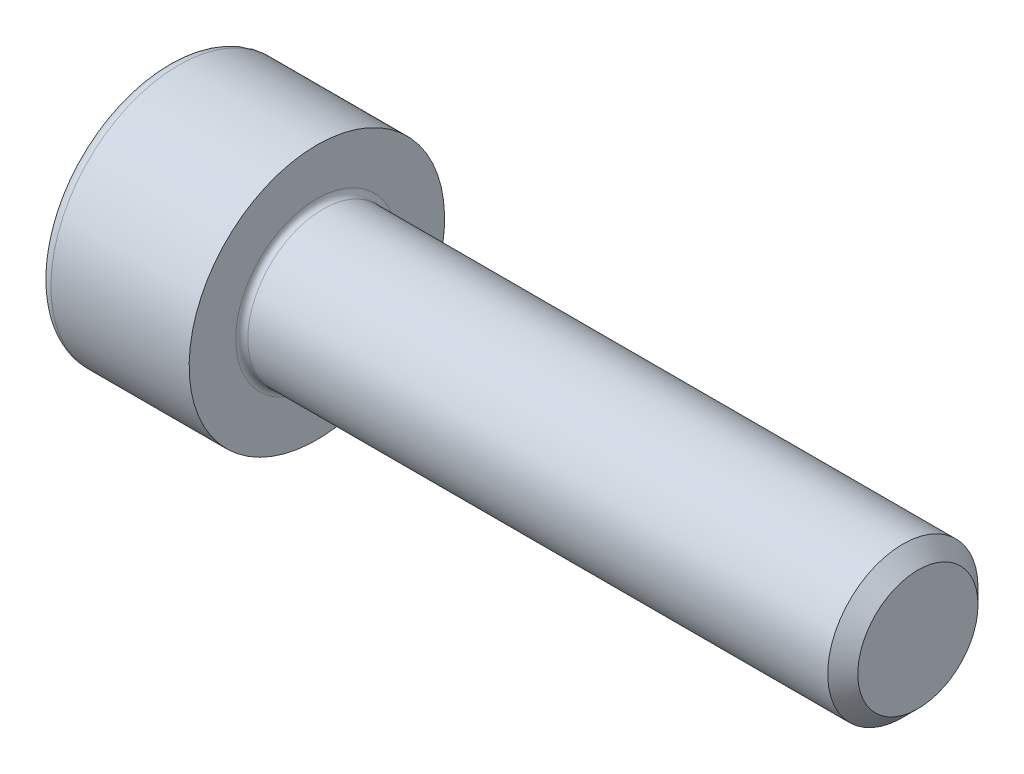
ISO-10303-21;
HEADER;
FILE_DESCRIPTION(('STEP AP214'),'2;1');
FILE_NAME('part.step','',(''),(''),'','','');
FILE_SCHEMA(('AUTOMOTIVE_DESIGN { 1 0 10303 214 1 1 1 1 }'));
ENDSEC;
DATA;
#1=APPLICATION_CONTEXT('core data for automotive mechanical design processes');
#2=APPLICATION_PROTOCOL_DEFINITION('international standard','automotive_design',2000,#1);
#3=PRODUCT_CONTEXT('',#1,'mechanical');
#4=PRODUCT('Part','Part','',(#3));
#5=PRODUCT_RELATED_PRODUCT_CATEGORY('part','',(#4));
#6=PRODUCT_DEFINITION_FORMATION('','',#4);
#7=PRODUCT_DEFINITION_CONTEXT('part definition',#1,'design');
#8=PRODUCT_DEFINITION('design','',#6,#7);
#9=PRODUCT_DEFINITION_SHAPE('','',#8);
#10=(LENGTH_UNIT() NAMED_UNIT(*) SI_UNIT(.MILLI.,.METRE.));
#11=(NAMED_UNIT(*) PLANE_ANGLE_UNIT() SI_UNIT($,.RADIAN.));
#12=(NAMED_UNIT(*) SI_UNIT($,.STERADIAN.) SOLID_ANGLE_UNIT());
#13=UNCERTAINTY_MEASURE_WITH_UNIT(LENGTH_MEASURE(1.E-05),#10,'distance_accuracy_value','');
#14=(GEOMETRIC_REPRESENTATION_CONTEXT(3) GLOBAL_UNCERTAINTY_ASSIGNED_CONTEXT((#13)) GLOBAL_UNIT_ASSIGNED_CONTEXT((#10,
#11,#12)) REPRESENTATION_CONTEXT('',''));
#15=CARTESIAN_POINT('',(0.,0.,0.));
#16=DIRECTION('',(0.,0.,1.));
#17=DIRECTION('',(1.,0.,0.));
#18=AXIS2_PLACEMENT_3D('',#15,#16,#17);
#19=CARTESIAN_POINT('',(-53.,-15.5,-45.5000000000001));
#20=DIRECTION('',(-1.,0.,0.));
#21=DIRECTION('',(0.,0.,1.));
#22=AXIS2_PLACEMENT_3D('',#19,#20,#21);
#23=CYLINDRICAL_SURFACE('',#22,2.5);
#24=CARTESIAN_POINT('',(-34.7999999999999,-15.5,-45.5000000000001));
#25=DIRECTION('',(1.,0.,0.));
#26=DIRECTION('',(0.,0.,-1.));
#27=AXIS2_PLACEMENT_3D('',#24,#25,#26);
#28=CIRCLE('',#27,2.5);
#29=CARTESIAN_POINT('',(-34.7999999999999,-15.5,-48.0000000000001));
#30=VERTEX_POINT('',#29);
#31=EDGE_CURVE('E11',#30,#30,#28,.F.);
#32=ORIENTED_EDGE('',*,*,#31,.T.);
#33=EDGE_LOOP('',(#32));
#34=FACE_BOUND('',#33,.T.);
#35=CARTESIAN_POINT('',(-54.1,-15.5,-45.5000000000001));
#36=DIRECTION('',(1.,0.,0.));
#37=DIRECTION('',(0.,1.,0.));
#38=AXIS2_PLACEMENT_3D('',#35,#36,#37);
#39=CIRCLE('',#38,2.5);
#40=CARTESIAN_POINT('',(-54.1,-13.,-45.5000000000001));
#41=VERTEX_POINT('',#40);
#42=EDGE_CURVE('E131',#41,#41,#39,.T.);
#43=ORIENTED_EDGE('',*,*,#42,.T.);
#44=EDGE_LOOP('',(#43));
#45=FACE_BOUND('',#44,.T.);
#46=ADVANCED_FACE('F38',(#34,#45),#23,.T.);
#47=CARTESIAN_POINT('',(-54.1,-15.5,-45.5000000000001));
#48=DIRECTION('',(1.,0.,0.));
#49=DIRECTION('',(0.,0.,-1.));
#50=AXIS2_PLACEMENT_3D('',#47,#48,#49);
#51=TOROIDAL_SURFACE('',#50,2.70000000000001,0.2);
#52=CARTESIAN_POINT('',(-54.3,-15.5,-45.5000000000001));
#53=DIRECTION('',(1.,0.,0.));
#54=DIRECTION('',(0.,1.,0.));
#55=AXIS2_PLACEMENT_3D('',#52,#53,#54);
#56=CIRCLE('',#55,2.7);
#57=CARTESIAN_POINT('',(-54.3,-12.8,-45.5000000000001));
#58=VERTEX_POINT('',#57);
#59=EDGE_CURVE('E134',#58,#58,#56,.T.);
#60=ORIENTED_EDGE('',*,*,#59,.T.);
#61=EDGE_LOOP('',(#60));
#62=FACE_BOUND('',#61,.T.);
#63=ORIENTED_EDGE('',*,*,#42,.F.);
#64=EDGE_LOOP('',(#63));
#65=FACE_BOUND('',#64,.T.);
#66=ADVANCED_FACE('F168',(#62,#65),#51,.F.);
#67=CARTESIAN_POINT('',(-54.3,-12.025,-45.5));
#68=DIRECTION('',(1.,0.,0.));
#69=DIRECTION('',(0.,0.,-1.));
#70=AXIS2_PLACEMENT_3D('',#67,#68,#69);
#71=PLANE('',#70);
#72=CARTESIAN_POINT('',(-54.3,-15.5,-45.5000000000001));
#73=DIRECTION('',(1.,0.,0.));
#74=DIRECTION('',(0.,1.,0.));
#75=AXIS2_PLACEMENT_3D('',#72,#73,#74);
#76=CIRCLE('',#75,4.25);
#77=CARTESIAN_POINT('',(-54.3,-11.25,-45.5000000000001));
#78=VERTEX_POINT('',#77);
#79=EDGE_CURVE('E140',#78,#78,#76,.T.);
#80=ORIENTED_EDGE('',*,*,#79,.T.);
#81=EDGE_LOOP('',(#80));
#82=FACE_BOUND('',#81,.T.);
#83=ORIENTED_EDGE('',*,*,#59,.F.);
#84=EDGE_LOOP('',(#83));
#85=FACE_BOUND('',#84,.T.);
#86=ADVANCED_FACE('F172',(#82,#85),#71,.T.);
#87=CARTESIAN_POINT('',(-56.6,-15.5,-45.5000000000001));
#88=DIRECTION('',(-1.,0.,0.));
#89=DIRECTION('',(0.,0.,1.));
#90=AXIS2_PLACEMENT_3D('',#87,#88,#89);
#91=CYLINDRICAL_SURFACE('',#90,4.25);
#92=CARTESIAN_POINT('',(-58.8999999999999,-15.5,-45.5000000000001));
#93=DIRECTION('',(1.,0.,0.));
#94=DIRECTION('',(0.,1.,0.));
#95=AXIS2_PLACEMENT_3D('',#92,#93,#94);
#96=CIRCLE('',#95,4.25);
#97=CARTESIAN_POINT('',(-58.8999999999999,-11.25,-45.5000000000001));
#98=VERTEX_POINT('',#97);
#99=EDGE_CURVE('E163',#98,#98,#96,.T.);
#100=ORIENTED_EDGE('',*,*,#99,.T.);
#101=EDGE_LOOP('',(#100));
#102=FACE_BOUND('',#101,.T.);
#103=ORIENTED_EDGE('',*,*,#79,.F.);
#104=EDGE_LOOP('',(#103));
#105=FACE_BOUND('',#104,.T.);
#106=ADVANCED_FACE('F177',(#102,#105),#91,.T.);
#107=CARTESIAN_POINT('',(-58.8999999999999,-15.5,-45.5000000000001));
#108=DIRECTION('',(1.,0.,0.));
#109=DIRECTION('',(0.,0.,-1.));
#110=AXIS2_PLACEMENT_3D('',#107,#108,#109);
#111=TOROIDAL_SURFACE('',#110,3.85000000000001,0.4);
#112=CARTESIAN_POINT('',(-59.3,-15.5,-45.5000000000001));
#113=DIRECTION('',(1.,0.,0.));
#114=DIRECTION('',(0.,1.,0.));
#115=AXIS2_PLACEMENT_3D('',#112,#113,#114);
#116=CIRCLE('',#115,3.85);
#117=CARTESIAN_POINT('',(-59.3,-11.65,-45.5000000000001));
#118=VERTEX_POINT('',#117);
#119=EDGE_CURVE('E136',#118,#118,#116,.T.);
#120=ORIENTED_EDGE('',*,*,#119,.T.);
#121=EDGE_LOOP('',(#120));
#122=FACE_BOUND('',#121,.T.);
#123=ORIENTED_EDGE('',*,*,#99,.F.);
#124=EDGE_LOOP('',(#123));
#125=FACE_BOUND('',#124,.T.);
#126=ADVANCED_FACE('F181',(#122,#125),#111,.T.);
#127=CARTESIAN_POINT('',(-59.3,-13.575,-45.5));
#128=DIRECTION('',(-1.,0.,0.));
#129=DIRECTION('',(0.,0.,1.));
#130=AXIS2_PLACEMENT_3D('',#127,#128,#129);
#131=PLANE('',#130);
#132=ORIENTED_EDGE('',*,*,#119,.F.);
#133=EDGE_LOOP('',(#132));
#134=FACE_BOUND('',#133,.T.);
#135=DIRECTION('',(0.,-0.5,-0.866025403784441));
#136=VECTOR('',#135,1.);
#137=CARTESIAN_POINT('',(-59.3,-16.7027506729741,-43.5832252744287));
#138=LINE('',#137,#136);
#139=CARTESIAN_POINT('',(-59.3,-16.6547005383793,-43.5000000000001));
#140=VERTEX_POINT('',#139);
#141=CARTESIAN_POINT('',(-59.3,-17.8094010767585,-45.5));
#142=VERTEX_POINT('',#141);
#143=EDGE_CURVE('E112',#140,#142,#138,.T.);
#144=ORIENTED_EDGE('',*,*,#143,.T.);
#145=DIRECTION('',(0.,0.5,-0.866025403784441));
#146=VECTOR('',#145,1.);
#147=CARTESIAN_POINT('',(-59.3,-17.2801009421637,-46.4167747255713));
#148=LINE('',#147,#146);
#149=CARTESIAN_POINT('',(-59.3,-16.6547005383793,-47.5000000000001));
#150=VERTEX_POINT('',#149);
#151=EDGE_CURVE('E56',#142,#150,#148,.T.);
#152=ORIENTED_EDGE('',*,*,#151,.T.);
#153=DIRECTION('',(0.,1.,0.));
#154=VECTOR('',#153,1.);
#155=CARTESIAN_POINT('',(-59.3,-15.1148502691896,-47.5000000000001));
#156=LINE('',#155,#154);
#157=CARTESIAN_POINT('',(-59.3,-14.3452994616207,-47.5000000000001));
#158=VERTEX_POINT('',#157);
#159=EDGE_CURVE('E156',#150,#158,#156,.T.);
#160=ORIENTED_EDGE('',*,*,#159,.T.);
#161=DIRECTION('',(0.,0.500000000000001,0.866025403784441));
#162=VECTOR('',#161,1.);
#163=CARTESIAN_POINT('',(-59.3,-13.815999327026,-46.5832252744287));
#164=LINE('',#163,#162);
#165=CARTESIAN_POINT('',(-59.3,-13.1905989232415,-45.5000000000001));
#166=VERTEX_POINT('',#165);
#167=EDGE_CURVE('E144',#158,#166,#164,.T.);
#168=ORIENTED_EDGE('',*,*,#167,.T.);
#169=DIRECTION('',(0.,-0.500000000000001,0.86602540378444));
#170=VECTOR('',#169,1.);
#171=CARTESIAN_POINT('',(-59.3,-13.2386490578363,-45.4167747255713));
#172=LINE('',#171,#170);
#173=CARTESIAN_POINT('',(-59.3,-14.3452994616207,-43.5000000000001));
#174=VERTEX_POINT('',#173);
#175=EDGE_CURVE('E128',#166,#174,#172,.T.);
#176=ORIENTED_EDGE('',*,*,#175,.T.);
#177=DIRECTION('',(0.,-1.,0.));
#178=VECTOR('',#177,1.);
#179=CARTESIAN_POINT('',(-59.3,-13.9601497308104,-43.5));
#180=LINE('',#179,#178);
#181=EDGE_CURVE('E107',#174,#140,#180,.T.);
#182=ORIENTED_EDGE('',*,*,#181,.T.);
#183=EDGE_LOOP('',(#144,#152,#160,#168,#176,#182));
#184=FACE_BOUND('',#183,.T.);
#185=ADVANCED_FACE('F185',(#134,#184),#131,.T.);
#186=CARTESIAN_POINT('',(-56.8,-15.5,-45.5000000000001));
#187=DIRECTION('',(-1.,0.,0.));
#188=DIRECTION('',(0.,-1.,0.));
#189=AXIS2_PLACEMENT_3D('',#186,#187,#188);
#190=PLANE('',#189);
#191=DIRECTION('',(0.,1.,0.));
#192=VECTOR('',#191,1.);
#193=CARTESIAN_POINT('',(-56.8,-16.6547005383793,-43.5000000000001));
#194=LINE('',#193,#192);
#195=CARTESIAN_POINT('',(-56.8,-16.6547005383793,-43.5000000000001));
#196=VERTEX_POINT('',#195);
#197=CARTESIAN_POINT('',(-56.8,-14.3452994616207,-43.5000000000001));
#198=VERTEX_POINT('',#197);
#199=EDGE_CURVE('E87',#196,#198,#194,.T.);
#200=ORIENTED_EDGE('',*,*,#199,.T.);
#201=DIRECTION('',(0.,0.500000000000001,-0.86602540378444));
#202=VECTOR('',#201,1.);
#203=CARTESIAN_POINT('',(-56.8,-14.3452994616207,-43.5000000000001));
#204=LINE('',#203,#202);
#205=CARTESIAN_POINT('',(-56.8,-13.1905989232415,-45.5000000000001));
#206=VERTEX_POINT('',#205);
#207=EDGE_CURVE('E108',#198,#206,#204,.T.);
#208=ORIENTED_EDGE('',*,*,#207,.T.);
#209=DIRECTION('',(0.,-0.500000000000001,-0.866025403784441));
#210=VECTOR('',#209,1.);
#211=CARTESIAN_POINT('',(-56.8,-13.1905989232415,-45.5000000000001));
#212=LINE('',#211,#210);
#213=CARTESIAN_POINT('',(-56.8,-14.3452994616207,-47.5000000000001));
#214=VERTEX_POINT('',#213);
#215=EDGE_CURVE('E147',#206,#214,#212,.T.);
#216=ORIENTED_EDGE('',*,*,#215,.T.);
#217=DIRECTION('',(0.,-1.,0.));
#218=VECTOR('',#217,1.);
#219=CARTESIAN_POINT('',(-56.8,-14.3452994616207,-47.5000000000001));
#220=LINE('',#219,#218);
#221=CARTESIAN_POINT('',(-56.8,-16.6547005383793,-47.5000000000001));
#222=VERTEX_POINT('',#221);
#223=EDGE_CURVE('E145',#214,#222,#220,.T.);
#224=ORIENTED_EDGE('',*,*,#223,.T.);
#225=DIRECTION('',(0.,-0.5,0.866025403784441));
#226=VECTOR('',#225,1.);
#227=CARTESIAN_POINT('',(-56.8,-16.6547005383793,-47.5000000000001));
#228=LINE('',#227,#226);
#229=CARTESIAN_POINT('',(-56.8,-17.8094010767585,-45.5));
#230=VERTEX_POINT('',#229);
#231=EDGE_CURVE('E91',#222,#230,#228,.T.);
#232=ORIENTED_EDGE('',*,*,#231,.T.);
#233=DIRECTION('',(0.,0.5,0.866025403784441));
#234=VECTOR('',#233,1.);
#235=CARTESIAN_POINT('',(-56.8,-17.8094010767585,-45.5));
#236=LINE('',#235,#234);
#237=EDGE_CURVE('E83',#230,#196,#236,.T.);
#238=ORIENTED_EDGE('',*,*,#237,.T.);
#239=EDGE_LOOP('',(#200,#208,#216,#224,#232,#238));
#240=FACE_BOUND('',#239,.T.);
#241=ADVANCED_FACE('F85',(#240),#190,.T.);
#242=CARTESIAN_POINT('',(-56.8,-16.6547005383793,-47.5000000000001));
#243=DIRECTION('',(0.,0.,1.));
#244=DIRECTION('',(1.,0.,0.));
#245=AXIS2_PLACEMENT_3D('',#242,#243,#244);
#246=PLANE('',#245);
#247=ORIENTED_EDGE('',*,*,#159,.F.);
#248=DIRECTION('',(-1.,0.,0.));
#249=VECTOR('',#248,1.);
#250=CARTESIAN_POINT('',(-56.8,-16.6547005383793,-47.5000000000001));
#251=LINE('',#250,#249);
#252=EDGE_CURVE('E119',#222,#150,#251,.T.);
#253=ORIENTED_EDGE('',*,*,#252,.F.);
#254=ORIENTED_EDGE('',*,*,#223,.F.);
#255=DIRECTION('',(-1.,0.,0.));
#256=VECTOR('',#255,1.);
#257=CARTESIAN_POINT('',(-56.8,-14.3452994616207,-47.5000000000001));
#258=LINE('',#257,#256);
#259=EDGE_CURVE('E96',#214,#158,#258,.T.);
#260=ORIENTED_EDGE('',*,*,#259,.T.);
#261=EDGE_LOOP('',(#247,#253,#254,#260));
#262=FACE_BOUND('',#261,.T.);
#263=ADVANCED_FACE('F192',(#262),#246,.T.);
#264=CARTESIAN_POINT('',(-56.8,-17.8094010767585,-45.5));
#265=DIRECTION('',(0.,0.866025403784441,0.5));
#266=DIRECTION('',(0.,-0.5,0.866025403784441));
#267=AXIS2_PLACEMENT_3D('',#264,#265,#266);
#268=PLANE('',#267);
#269=ORIENTED_EDGE('',*,*,#151,.F.);
#270=DIRECTION('',(-1.,0.,0.));
#271=VECTOR('',#270,1.);
#272=CARTESIAN_POINT('',(-56.8,-17.8094010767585,-45.5));
#273=LINE('',#272,#271);
#274=EDGE_CURVE('E114',#230,#142,#273,.T.);
#275=ORIENTED_EDGE('',*,*,#274,.F.);
#276=ORIENTED_EDGE('',*,*,#231,.F.);
#277=ORIENTED_EDGE('',*,*,#252,.T.);
#278=EDGE_LOOP('',(#269,#275,#276,#277));
#279=FACE_BOUND('',#278,.T.);
#280=ADVANCED_FACE('F195',(#279),#268,.T.);
#281=CARTESIAN_POINT('',(-56.8,-16.6547005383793,-43.5000000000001));
#282=DIRECTION('',(0.,0.866025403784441,-0.5));
#283=DIRECTION('',(0.,0.5,0.866025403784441));
#284=AXIS2_PLACEMENT_3D('',#281,#282,#283);
#285=PLANE('',#284);
#286=ORIENTED_EDGE('',*,*,#143,.F.);
#287=DIRECTION('',(-1.,0.,0.));
#288=VECTOR('',#287,1.);
#289=CARTESIAN_POINT('',(-56.8,-16.6547005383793,-43.5000000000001));
#290=LINE('',#289,#288);
#291=EDGE_CURVE('E103',#196,#140,#290,.T.);
#292=ORIENTED_EDGE('',*,*,#291,.F.);
#293=ORIENTED_EDGE('',*,*,#237,.F.);
#294=ORIENTED_EDGE('',*,*,#274,.T.);
#295=EDGE_LOOP('',(#286,#292,#293,#294));
#296=FACE_BOUND('',#295,.T.);
#297=ADVANCED_FACE('F111',(#296),#285,.T.);
#298=CARTESIAN_POINT('',(-56.8,-14.3452994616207,-43.5000000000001));
#299=DIRECTION('',(0.,0.,-1.));
#300=DIRECTION('',(-1.,0.,0.));
#301=AXIS2_PLACEMENT_3D('',#298,#299,#300);
#302=PLANE('',#301);
#303=ORIENTED_EDGE('',*,*,#181,.F.);
#304=DIRECTION('',(-1.,0.,0.));
#305=VECTOR('',#304,1.);
#306=CARTESIAN_POINT('',(-56.8,-14.3452994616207,-43.5000000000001));
#307=LINE('',#306,#305);
#308=EDGE_CURVE('E105',#198,#174,#307,.T.);
#309=ORIENTED_EDGE('',*,*,#308,.F.);
#310=ORIENTED_EDGE('',*,*,#199,.F.);
#311=ORIENTED_EDGE('',*,*,#291,.T.);
#312=EDGE_LOOP('',(#303,#309,#310,#311));
#313=FACE_BOUND('',#312,.T.);
#314=ADVANCED_FACE('F102',(#313),#302,.T.);
#315=CARTESIAN_POINT('',(-56.8,-13.1905989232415,-45.5000000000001));
#316=DIRECTION('',(0.,-0.86602540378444,-0.500000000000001));
#317=DIRECTION('',(0.,0.500000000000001,-0.86602540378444));
#318=AXIS2_PLACEMENT_3D('',#315,#316,#317);
#319=PLANE('',#318);
#320=ORIENTED_EDGE('',*,*,#175,.F.);
#321=DIRECTION('',(-1.,0.,0.));
#322=VECTOR('',#321,1.);
#323=CARTESIAN_POINT('',(-56.8,-13.1905989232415,-45.5000000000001));
#324=LINE('',#323,#322);
#325=EDGE_CURVE('E122',#206,#166,#324,.T.);
#326=ORIENTED_EDGE('',*,*,#325,.F.);
#327=ORIENTED_EDGE('',*,*,#207,.F.);
#328=ORIENTED_EDGE('',*,*,#308,.T.);
#329=EDGE_LOOP('',(#320,#326,#327,#328));
#330=FACE_BOUND('',#329,.T.);
#331=ADVANCED_FACE('F203',(#330),#319,.T.);
#332=CARTESIAN_POINT('',(-56.8,-14.3452994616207,-47.5000000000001));
#333=DIRECTION('',(0.,-0.866025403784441,0.500000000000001));
#334=DIRECTION('',(0.,-0.500000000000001,-0.866025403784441));
#335=AXIS2_PLACEMENT_3D('',#332,#333,#334);
#336=PLANE('',#335);
#337=ORIENTED_EDGE('',*,*,#167,.F.);
#338=ORIENTED_EDGE('',*,*,#259,.F.);
#339=ORIENTED_EDGE('',*,*,#215,.F.);
#340=ORIENTED_EDGE('',*,*,#325,.T.);
#341=EDGE_LOOP('',(#337,#338,#339,#340));
#342=FACE_BOUND('',#341,.T.);
#343=ADVANCED_FACE('F205',(#342),#336,.T.);
#344=CARTESIAN_POINT('',(-34.3,-15.5,-45.5000000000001));
#345=DIRECTION('',(1.,0.,0.));
#346=DIRECTION('',(0.,0.,-1.));
#347=AXIS2_PLACEMENT_3D('',#344,#345,#346);
#348=PLANE('',#347);
#349=CARTESIAN_POINT('',(-34.3,-15.5,-45.5000000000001));
#350=DIRECTION('',(1.,0.,0.));
#351=DIRECTION('',(0.,0.,-1.));
#352=AXIS2_PLACEMENT_3D('',#349,#350,#351);
#353=CIRCLE('',#352,2.);
#354=CARTESIAN_POINT('',(-34.3,-15.5,-47.5000000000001));
#355=VERTEX_POINT('',#354);
#356=EDGE_CURVE('E48',#355,#355,#353,.T.);
#357=ORIENTED_EDGE('',*,*,#356,.T.);
#358=EDGE_LOOP('',(#357));
#359=FACE_BOUND('',#358,.T.);
#360=ADVANCED_FACE('F40',(#359),#348,.T.);
#361=CARTESIAN_POINT('',(-34.3,-15.5,-45.5000000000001));
#362=DIRECTION('',(-1.,0.,0.));
#363=DIRECTION('',(0.,0.,1.));
#364=AXIS2_PLACEMENT_3D('',#361,#362,#363);
#365=CONICAL_SURFACE('',#364,2.,0.785398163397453);
#366=ORIENTED_EDGE('',*,*,#31,.F.);
#367=EDGE_LOOP('',(#366));
#368=FACE_BOUND('',#367,.T.);
#369=ORIENTED_EDGE('',*,*,#356,.F.);
#370=EDGE_LOOP('',(#369));
#371=FACE_BOUND('',#370,.T.);
#372=ADVANCED_FACE('F212',(#368,#371),#365,.T.);
#373=CLOSED_SHELL('',(#46,#66,#86,#106,#126,#185,#241,#263,#280,#297,#314,#331,#343,#360,#372));
#374=MANIFOLD_SOLID_BREP('B2',#373);
#375=ADVANCED_BREP_SHAPE_REPRESENTATION('',(#18,#374),#14);
#376=SHAPE_DEFINITION_REPRESENTATION(#9,#375);
ENDSEC;
END-ISO-10303-21;
